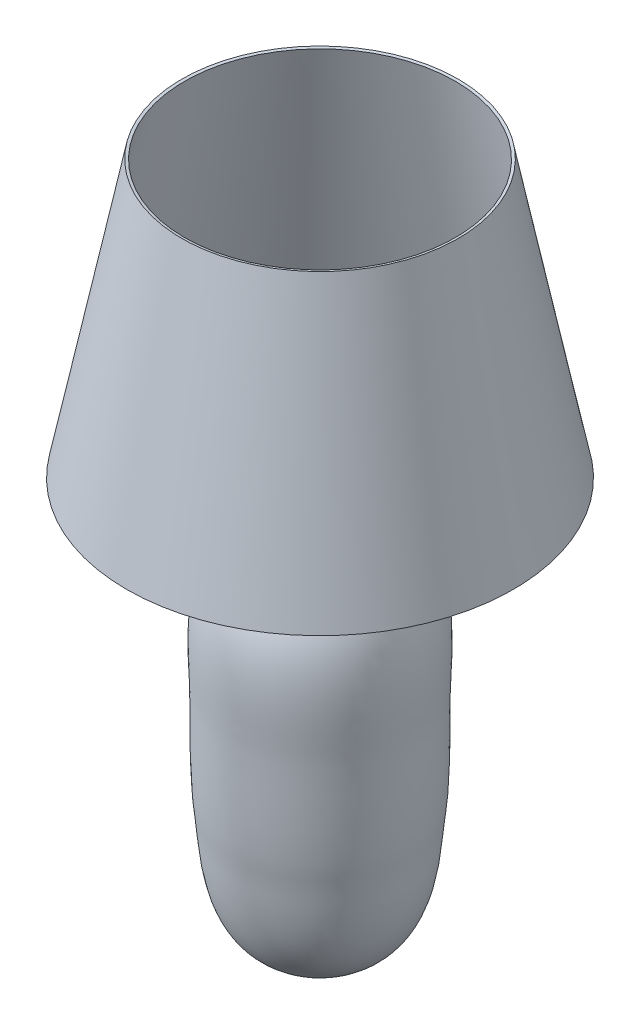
ISO-10303-21;
HEADER;
FILE_DESCRIPTION(('STEP AP214'),'2;1');
FILE_NAME('part.step','',(''),(''),'','','');
FILE_SCHEMA(('AUTOMOTIVE_DESIGN { 1 0 10303 214 1 1 1 1 }'));
ENDSEC;
DATA;
#1=APPLICATION_CONTEXT('core data for automotive mechanical design processes');
#2=APPLICATION_PROTOCOL_DEFINITION('international standard','automotive_design',2000,#1);
#3=PRODUCT_CONTEXT('',#1,'mechanical');
#4=PRODUCT('Part','Part','',(#3));
#5=PRODUCT_RELATED_PRODUCT_CATEGORY('part','',(#4));
#6=PRODUCT_DEFINITION_FORMATION('','',#4);
#7=PRODUCT_DEFINITION_CONTEXT('part definition',#1,'design');
#8=PRODUCT_DEFINITION('design','',#6,#7);
#9=PRODUCT_DEFINITION_SHAPE('','',#8);
#10=(LENGTH_UNIT() NAMED_UNIT(*) SI_UNIT(.MILLI.,.METRE.));
#11=(NAMED_UNIT(*) PLANE_ANGLE_UNIT() SI_UNIT($,.RADIAN.));
#12=(NAMED_UNIT(*) SI_UNIT($,.STERADIAN.) SOLID_ANGLE_UNIT());
#13=UNCERTAINTY_MEASURE_WITH_UNIT(LENGTH_MEASURE(1.E-05),#10,'distance_accuracy_value','');
#14=(GEOMETRIC_REPRESENTATION_CONTEXT(3) GLOBAL_UNCERTAINTY_ASSIGNED_CONTEXT((#13)) GLOBAL_UNIT_ASSIGNED_CONTEXT((#10,
#11,#12)) REPRESENTATION_CONTEXT('',''));
#15=CARTESIAN_POINT('',(0.,0.,0.));
#16=DIRECTION('',(0.,0.,1.));
#17=DIRECTION('',(1.,0.,0.));
#18=AXIS2_PLACEMENT_3D('',#15,#16,#17);
#19=CARTESIAN_POINT('',(875.943412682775,483.621135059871,0.));
#20=DIRECTION('',(0.,-1.,0.));
#21=DIRECTION('',(0.,0.,-1.));
#22=AXIS2_PLACEMENT_3D('',#19,#20,#21);
#23=CONICAL_SURFACE('',#22,206.340588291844,0.197395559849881);
#24=CARTESIAN_POINT('',(875.943412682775,780.032786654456,0.));
#25=DIRECTION('',(0.,-1.,0.));
#26=DIRECTION('',(0.,0.,-1.));
#27=AXIS2_PLACEMENT_3D('',#24,#25,#26);
#28=CIRCLE('',#27,147.058257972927);
#29=CARTESIAN_POINT('',(875.943412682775,780.032786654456,-147.058257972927));
#30=VERTEX_POINT('',#29);
#31=EDGE_CURVE('E10',#30,#30,#28,.T.);
#32=ORIENTED_EDGE('',*,*,#31,.F.);
#33=EDGE_LOOP('',(#32));
#34=FACE_BOUND('',#33,.T.);
#35=CARTESIAN_POINT('',(875.943412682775,483.621135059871,0.));
#36=DIRECTION('',(0.,-1.,0.));
#37=DIRECTION('',(0.,0.,-1.));
#38=AXIS2_PLACEMENT_3D('',#35,#36,#37);
#39=CIRCLE('',#38,206.340588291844);
#40=CARTESIAN_POINT('',(875.943412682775,483.621135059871,-206.340588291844));
#41=VERTEX_POINT('',#40);
#42=EDGE_CURVE('E71',#41,#41,#39,.T.);
#43=ORIENTED_EDGE('',*,*,#42,.T.);
#44=EDGE_LOOP('',(#43));
#45=FACE_BOUND('',#44,.T.);
#46=ADVANCED_FACE('F31',(#34,#45),#23,.F.);
#47=CARTESIAN_POINT('',(875.943412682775,780.621135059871,0.));
#48=DIRECTION('',(0.,1.,0.));
#49=DIRECTION('',(0.,0.,1.));
#50=AXIS2_PLACEMENT_3D('',#47,#48,#49);
#51=CONICAL_SURFACE('',#50,150.,1.37340076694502);
#52=ORIENTED_EDGE('',*,*,#31,.T.);
#53=EDGE_LOOP('',(#52));
#54=FACE_BOUND('',#53,.T.);
#55=CARTESIAN_POINT('',(875.943412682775,780.621135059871,0.));
#56=DIRECTION('',(0.,-1.,0.));
#57=DIRECTION('',(0.,0.,-1.));
#58=AXIS2_PLACEMENT_3D('',#55,#56,#57);
#59=CIRCLE('',#58,150.);
#60=CARTESIAN_POINT('',(875.943412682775,780.621135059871,-150.));
#61=VERTEX_POINT('',#60);
#62=EDGE_CURVE('E37',#61,#61,#59,.T.);
#63=ORIENTED_EDGE('',*,*,#62,.F.);
#64=EDGE_LOOP('',(#63));
#65=FACE_BOUND('',#64,.T.);
#66=ADVANCED_FACE('F118',(#54,#65),#51,.F.);
#67=CARTESIAN_POINT('',(875.943412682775,480.621135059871,0.));
#68=DIRECTION('',(0.,-1.,0.));
#69=DIRECTION('',(0.,0.,-1.));
#70=AXIS2_PLACEMENT_3D('',#67,#68,#69);
#71=CONICAL_SURFACE('',#70,210.,0.197395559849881);
#72=ORIENTED_EDGE('',*,*,#62,.T.);
#73=EDGE_LOOP('',(#72));
#74=FACE_BOUND('',#73,.T.);
#75=CARTESIAN_POINT('',(875.943412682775,480.621135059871,0.));
#76=DIRECTION('',(0.,-1.,0.));
#77=DIRECTION('',(0.,0.,-1.));
#78=AXIS2_PLACEMENT_3D('',#75,#76,#77);
#79=CIRCLE('',#78,210.);
#80=CARTESIAN_POINT('',(875.943412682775,480.621135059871,-210.));
#81=VERTEX_POINT('',#80);
#82=EDGE_CURVE('E41',#81,#81,#79,.T.);
#83=ORIENTED_EDGE('',*,*,#82,.F.);
#84=EDGE_LOOP('',(#83));
#85=FACE_BOUND('',#84,.T.);
#86=ADVANCED_FACE('F115',(#74,#85),#71,.T.);
#87=CARTESIAN_POINT('',(865.943412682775,480.621135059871,0.));
#88=DIRECTION('',(0.,-1.,0.));
#89=DIRECTION('',(0.,0.,-1.));
#90=AXIS2_PLACEMENT_3D('',#87,#88,#89);
#91=PLANE('',#90);
#92=ORIENTED_EDGE('',*,*,#82,.T.);
#93=EDGE_LOOP('',(#92));
#94=FACE_BOUND('',#93,.T.);
#95=CARTESIAN_POINT('',(875.943412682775,480.621135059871,0.));
#96=DIRECTION('',(0.,-1.,0.));
#97=DIRECTION('',(0.,0.,-1.));
#98=AXIS2_PLACEMENT_3D('',#95,#96,#97);
#99=CIRCLE('',#98,10.);
#100=CARTESIAN_POINT('',(875.943412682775,480.621135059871,-10.));
#101=VERTEX_POINT('',#100);
#102=EDGE_CURVE('E45',#101,#101,#99,.T.);
#103=ORIENTED_EDGE('',*,*,#102,.F.);
#104=EDGE_LOOP('',(#103));
#105=FACE_BOUND('',#104,.T.);
#106=ADVANCED_FACE('F111',(#94,#105),#91,.T.);
#107=CARTESIAN_POINT('',(875.943412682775,40.6211350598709,0.));
#108=DIRECTION('',(0.,-1.,0.));
#109=DIRECTION('',(0.,0.,-1.));
#110=AXIS2_PLACEMENT_3D('',#107,#108,#109);
#111=CYLINDRICAL_SURFACE('',#110,10.);
#112=ORIENTED_EDGE('',*,*,#102,.T.);
#113=EDGE_LOOP('',(#112));
#114=FACE_BOUND('',#113,.T.);
#115=CARTESIAN_POINT('',(875.943412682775,440.621135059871,0.));
#116=DIRECTION('',(0.,-1.,0.));
#117=DIRECTION('',(0.,0.,-1.));
#118=AXIS2_PLACEMENT_3D('',#115,#116,#117);
#119=CIRCLE('',#118,10.);
#120=CARTESIAN_POINT('',(875.943412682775,440.621135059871,-10.));
#121=VERTEX_POINT('',#120);
#122=EDGE_CURVE('E50',#121,#121,#119,.T.);
#123=ORIENTED_EDGE('',*,*,#122,.F.);
#124=EDGE_LOOP('',(#123));
#125=FACE_BOUND('',#124,.T.);
#126=ADVANCED_FACE('F107',(#114,#125),#111,.T.);
#127=CARTESIAN_POINT('',(828.443412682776,440.621135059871,0.));
#128=DIRECTION('',(0.,1.,0.));
#129=DIRECTION('',(0.,0.,1.));
#130=AXIS2_PLACEMENT_3D('',#127,#128,#129);
#131=PLANE('',#130);
#132=ORIENTED_EDGE('',*,*,#122,.T.);
#133=EDGE_LOOP('',(#132));
#134=FACE_BOUND('',#133,.T.);
#135=CARTESIAN_POINT('',(875.943412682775,440.621135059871,0.));
#136=DIRECTION('',(0.,-1.,0.));
#137=DIRECTION('',(0.,0.,-1.));
#138=AXIS2_PLACEMENT_3D('',#135,#136,#137);
#139=CIRCLE('',#138,47.5000000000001);
#140=CARTESIAN_POINT('',(875.943412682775,440.621135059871,-47.5000000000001));
#141=VERTEX_POINT('',#140);
#142=EDGE_CURVE('E53',#141,#141,#139,.T.);
#143=ORIENTED_EDGE('',*,*,#142,.F.);
#144=EDGE_LOOP('',(#143));
#145=FACE_BOUND('',#144,.T.);
#146=ADVANCED_FACE('F103',(#134,#145),#131,.T.);
#147=CARTESIAN_POINT('',(835.943412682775,40.6211350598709,0.));
#148=CARTESIAN_POINT('',(784.293239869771,62.3198451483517,0.));
#149=CARTESIAN_POINT('',(783.375095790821,140.255779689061,0.));
#150=CARTESIAN_POINT('',(776.187963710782,192.83547645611,0.));
#151=CARTESIAN_POINT('',(775.846769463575,249.312043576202,0.));
#152=CARTESIAN_POINT('',(776.149689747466,307.95190692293,0.));
#153=CARTESIAN_POINT('',(768.786562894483,366.548122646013,0.));
#154=CARTESIAN_POINT('',(800.160031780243,422.265295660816,0.));
#155=CARTESIAN_POINT('',(826.835757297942,435.904925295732,0.));
#156=CARTESIAN_POINT('',(828.90845791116,434.982570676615,0.));
#157=CARTESIAN_POINT('',(828.443412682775,440.621135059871,0.));
#158=B_SPLINE_CURVE_WITH_KNOTS('',3,(#147,#148,#149,#150,#151,#152,#153,#154,#155,#156,#157),
.UNSPECIFIED.,.F.,.F.,(4,1,1,1,1,1,1,1,4),(0.,0.244664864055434,0.281494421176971,
0.444805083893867,0.503002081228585,0.805267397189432,0.855039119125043,0.962936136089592,1.),.UNSPECIFIED.);
#159=CARTESIAN_POINT('',(875.943412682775,40.6211350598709,0.));
#160=DIRECTION('',(0.,-1.,0.));
#161=AXIS1_PLACEMENT('',#159,#160);
#162=SURFACE_OF_REVOLUTION('',#158,#161);
#163=ORIENTED_EDGE('',*,*,#142,.T.);
#164=EDGE_LOOP('',(#163));
#165=FACE_BOUND('',#164,.T.);
#166=CARTESIAN_POINT('',(875.943412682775,40.6211350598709,0.));
#167=DIRECTION('',(0.,-1.,0.));
#168=DIRECTION('',(0.,0.,-1.));
#169=AXIS2_PLACEMENT_3D('',#166,#167,#168);
#170=CIRCLE('',#169,40.);
#171=CARTESIAN_POINT('',(875.943412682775,40.6211350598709,-40.));
#172=VERTEX_POINT('',#171);
#173=EDGE_CURVE('E56',#172,#172,#170,.T.);
#174=ORIENTED_EDGE('',*,*,#173,.F.);
#175=EDGE_LOOP('',(#174));
#176=FACE_BOUND('',#175,.T.);
#177=ADVANCED_FACE('F99',(#165,#176),#162,.F.);
#178=CARTESIAN_POINT('',(875.943412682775,40.6211350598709,0.));
#179=DIRECTION('',(0.,-1.,0.));
#180=DIRECTION('',(0.,0.,-1.));
#181=AXIS2_PLACEMENT_3D('',#178,#179,#180);
#182=PLANE('',#181);
#183=ORIENTED_EDGE('',*,*,#173,.T.);
#184=EDGE_LOOP('',(#183));
#185=FACE_BOUND('',#184,.T.);
#186=ADVANCED_FACE('F95',(#185),#182,.T.);
#187=CARTESIAN_POINT('',(875.943412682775,43.6211350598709,0.));
#188=DIRECTION('',(0.,-1.,0.));
#189=DIRECTION('',(0.,0.,-1.));
#190=AXIS2_PLACEMENT_3D('',#187,#188,#189);
#191=PLANE('',#190);
#192=CARTESIAN_POINT('',(875.943412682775,43.6211350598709,0.));
#193=DIRECTION('',(0.,-1.,0.));
#194=DIRECTION('',(0.,0.,-1.));
#195=AXIS2_PLACEMENT_3D('',#192,#193,#194);
#196=CIRCLE('',#195,39.3890557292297);
#197=CARTESIAN_POINT('',(875.943412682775,43.6211350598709,-39.3890557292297));
#198=VERTEX_POINT('',#197);
#199=EDGE_CURVE('E59',#198,#198,#196,.T.);
#200=ORIENTED_EDGE('',*,*,#199,.F.);
#201=EDGE_LOOP('',(#200));
#202=FACE_BOUND('',#201,.T.);
#203=ADVANCED_FACE('F90',(#202),#191,.F.);
#204=CARTESIAN_POINT('',(836.554356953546,43.6211350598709,0.));
#205=CARTESIAN_POINT('',(830.324860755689,46.2989063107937,0.));
#206=CARTESIAN_POINT('',(824.897982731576,49.6669188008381,0.));
#207=CARTESIAN_POINT('',(815.374538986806,57.5011182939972,0.));
#208=CARTESIAN_POINT('',(811.277496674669,61.9696445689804,0.));
#209=CARTESIAN_POINT('',(804.191472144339,71.7410857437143,0.));
#210=CARTESIAN_POINT('',(801.20399260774,77.0443978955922,0.));
#211=CARTESIAN_POINT('',(796.14899129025,88.1867000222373,0.));
#212=CARTESIAN_POINT('',(794.082058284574,94.0250152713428,0.));
#213=CARTESIAN_POINT('',(788.972126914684,111.858494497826,0.));
#214=CARTESIAN_POINT('',(787.023360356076,124.169005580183,0.));
#215=CARTESIAN_POINT('',(785.045167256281,141.311333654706,0.));
#216=CARTESIAN_POINT('',(784.542433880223,146.805024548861,0.));
#217=CARTESIAN_POINT('',(783.86203191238,154.48002463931,0.));
#218=CARTESIAN_POINT('',(783.647485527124,156.944198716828,0.));
#219=CARTESIAN_POINT('',(783.215301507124,161.647441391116,0.));
#220=CARTESIAN_POINT('',(782.995779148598,163.886421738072,0.));
#221=CARTESIAN_POINT('',(782.534153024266,168.10283301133,0.));
#222=CARTESIAN_POINT('',(782.296371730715,170.093309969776,0.));
#223=CARTESIAN_POINT('',(781.832235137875,174.04750199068,0.));
#224=CARTESIAN_POINT('',(781.605858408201,176.011248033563,0.));
#225=CARTESIAN_POINT('',(781.291538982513,179.103720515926,0.));
#226=CARTESIAN_POINT('',(781.191107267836,180.162122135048,0.));
#227=CARTESIAN_POINT('',(780.998477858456,182.340386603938,0.));
#228=CARTESIAN_POINT('',(780.906304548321,183.458466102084,0.));
#229=CARTESIAN_POINT('',(780.64179083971,186.890570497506,0.));
#230=CARTESIAN_POINT('',(780.481464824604,189.282429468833,0.));
#231=CARTESIAN_POINT('',(779.753531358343,201.643772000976,0.));
#232=CARTESIAN_POINT('',(779.407597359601,212.816241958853,0.));
#233=CARTESIAN_POINT('',(779.004172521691,234.825801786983,0.));
#234=CARTESIAN_POINT('',(778.94629424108,245.664602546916,0.));
#235=CARTESIAN_POINT('',(778.936268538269,256.060015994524,0.));
#236=CARTESIAN_POINT('',(778.935918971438,257.190099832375,0.));
#237=CARTESIAN_POINT('',(778.936377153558,259.394774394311,0.));
#238=CARTESIAN_POINT('',(778.937227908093,260.46826567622,0.));
#239=CARTESIAN_POINT('',(778.940464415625,263.610792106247,0.));
#240=CARTESIAN_POINT('',(778.943442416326,265.603909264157,0.));
#241=CARTESIAN_POINT('',(778.943352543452,271.387372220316,0.));
#242=CARTESIAN_POINT('',(778.931282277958,274.982440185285,0.));
#243=CARTESIAN_POINT('',(778.848725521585,280.41526236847,0.));
#244=CARTESIAN_POINT('',(778.809396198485,282.238498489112,0.));
#245=CARTESIAN_POINT('',(778.708638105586,285.925312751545,0.));
#246=CARTESIAN_POINT('',(778.647999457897,287.786046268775,0.));
#247=CARTESIAN_POINT('',(778.44635296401,293.415270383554,0.));
#248=CARTESIAN_POINT('',(778.285634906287,297.230814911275,0.));
#249=CARTESIAN_POINT('',(777.812087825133,308.824767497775,0.));
#250=CARTESIAN_POINT('',(777.508106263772,316.750781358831,0.));
#251=CARTESIAN_POINT('',(777.383161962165,332.768723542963,0.));
#252=CARTESIAN_POINT('',(777.562262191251,340.860338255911,0.));
#253=CARTESIAN_POINT('',(778.85413678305,356.975766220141,0.));
#254=CARTESIAN_POINT('',(779.966846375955,364.999004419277,0.));
#255=CARTESIAN_POINT('',(783.566349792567,380.750856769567,0.));
#256=CARTESIAN_POINT('',(786.05326221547,388.481199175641,0.));
#257=CARTESIAN_POINT('',(791.142080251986,399.698320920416,0.));
#258=CARTESIAN_POINT('',(793.054174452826,403.342841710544,0.));
#259=CARTESIAN_POINT('',(796.391364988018,408.443201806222,0.));
#260=CARTESIAN_POINT('',(797.581780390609,410.082420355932,0.));
#261=CARTESIAN_POINT('',(799.502564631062,412.424584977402,0.));
#262=CARTESIAN_POINT('',(800.166217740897,413.185638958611,0.));
#263=CARTESIAN_POINT('',(801.544621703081,414.677799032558,0.));
#264=CARTESIAN_POINT('',(802.257485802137,415.40738543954,0.));
#265=CARTESIAN_POINT('',(805.912805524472,418.965271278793,0.));
#266=CARTESIAN_POINT('',(809.129203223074,421.521829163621,0.));
#267=CARTESIAN_POINT('',(815.424943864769,425.890688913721,0.));
#268=CARTESIAN_POINT('',(818.505416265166,427.70427423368,0.));
#269=CARTESIAN_POINT('',(822.461530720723,429.759875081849,0.));
#270=CARTESIAN_POINT('',(823.669664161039,430.334406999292,0.));
#271=CARTESIAN_POINT('',(825.233265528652,431.014475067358,0.));
#272=CARTESIAN_POINT('',(825.71294836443,431.210846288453,0.));
#273=CARTESIAN_POINT('',(826.570143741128,431.539476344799,0.));
#274=CARTESIAN_POINT('',(826.948207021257,431.671735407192,0.));
#275=CARTESIAN_POINT('',(827.337114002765,431.794181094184,0.));
#276=CARTESIAN_POINT('',(827.410648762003,431.816524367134,0.));
#277=CARTESIAN_POINT('',(827.548356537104,431.856851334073,0.));
#278=CARTESIAN_POINT('',(827.615510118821,431.87564492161,0.));
#279=CARTESIAN_POINT('',(827.843048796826,431.938250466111,0.));
#280=CARTESIAN_POINT('',(828.019959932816,431.984350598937,0.));
#281=CARTESIAN_POINT('',(828.463306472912,432.121131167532,0.));
#282=CARTESIAN_POINT('',(828.732852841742,432.211419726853,0.));
#283=CARTESIAN_POINT('',(829.209640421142,432.442024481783,0.));
#284=CARTESIAN_POINT('',(829.379973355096,432.535354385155,0.));
#285=CARTESIAN_POINT('',(829.729383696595,432.7642861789,0.));
#286=CARTESIAN_POINT('',(829.90819357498,432.900195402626,0.));
#287=CARTESIAN_POINT('',(830.250691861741,433.212394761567,0.));
#288=CARTESIAN_POINT('',(830.413827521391,433.388499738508,0.));
#289=CARTESIAN_POINT('',(830.704701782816,433.763694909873,0.));
#290=CARTESIAN_POINT('',(830.832325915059,433.962247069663,0.));
#291=CARTESIAN_POINT('',(831.048081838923,434.361930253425,0.));
#292=CARTESIAN_POINT('',(831.136534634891,434.562865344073,0.));
#293=CARTESIAN_POINT('',(831.281921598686,434.957131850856,0.));
#294=CARTESIAN_POINT('',(831.339099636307,435.150601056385,0.));
#295=CARTESIAN_POINT('',(831.478156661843,435.719972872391,0.));
#296=CARTESIAN_POINT('',(831.529173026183,436.084788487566,0.));
#297=CARTESIAN_POINT('',(831.593036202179,436.829486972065,0.));
#298=CARTESIAN_POINT('',(831.605005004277,437.210389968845,0.));
#299=CARTESIAN_POINT('',(831.604323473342,437.621135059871,0.));
#300=B_SPLINE_CURVE_WITH_KNOTS('',3,(#204,#205,#206,#207,#208,#209,#210,#211,#212,#213,#214,
#215,#216,#217,#218,#219,#220,#221,#222,#223,#224,#225,#226,#227,#228,#229,#230,#231,#232,#233,
#234,#235,#236,#237,#238,#239,#240,#241,#242,#243,#244,#245,#246,#247,#248,#249,#250,#251,#252,
#253,#254,#255,#256,#257,#258,#259,#260,#261,#262,#263,#264,#265,#266,#267,#268,#269,#270,#271,
#272,#273,#274,#275,#276,#277,#278,#279,#280,#281,#282,#283,#284,#285,#286,#287,#288,#289,#290,
#291,#292,#293,#294,#295,#296,#297,#298,#299),.UNSPECIFIED.,.F.,.F.,(4,2,2,2,2,2,2,2,2,2,2,2,2,
2,2,2,2,2,2,2,2,2,2,2,2,2,2,2,2,2,2,2,2,2,2,2,2,2,2,2,2,2,2,2,2,2,2,4),(0.,0.0312499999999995,
0.0624999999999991,0.0937499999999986,0.124999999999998,0.187499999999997,0.218749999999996,
0.234374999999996,0.249999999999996,0.265624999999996,0.281249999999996,0.289062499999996,
0.296874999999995,0.312499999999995,0.374999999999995,0.437499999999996,0.445312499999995,
0.453124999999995,0.468749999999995,0.499999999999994,0.515624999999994,0.531249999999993,
0.562499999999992,0.62499999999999,0.687499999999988,0.749999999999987,0.812499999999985,
0.843749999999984,0.859374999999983,0.867187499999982,0.874999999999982,0.906249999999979,
0.937499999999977,0.953124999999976,0.960937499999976,0.968749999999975,0.970703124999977,
0.972656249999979,0.976562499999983,0.980468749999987,0.982421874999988,0.98437499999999,
0.986328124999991,0.988281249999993,0.990234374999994,0.992187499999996,0.996093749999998,1.),.UNSPECIFIED.);
#301=CARTESIAN_POINT('',(875.943412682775,40.6211350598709,0.));
#302=DIRECTION('',(0.,-1.,0.));
#303=AXIS1_PLACEMENT('',#301,#302);
#304=SURFACE_OF_REVOLUTION('',#300,#303);
#305=CARTESIAN_POINT('',(875.943412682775,437.621135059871,0.));
#306=DIRECTION('',(0.,-1.,0.));
#307=DIRECTION('',(0.,0.,-1.));
#308=AXIS2_PLACEMENT_3D('',#305,#306,#307);
#309=CIRCLE('',#308,44.3390892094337);
#310=CARTESIAN_POINT('',(875.943412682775,437.621135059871,-44.3390892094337));
#311=VERTEX_POINT('',#310);
#312=EDGE_CURVE('E62',#311,#311,#309,.T.);
#313=ORIENTED_EDGE('',*,*,#312,.F.);
#314=EDGE_LOOP('',(#313));
#315=FACE_BOUND('',#314,.T.);
#316=ORIENTED_EDGE('',*,*,#199,.T.);
#317=EDGE_LOOP('',(#316));
#318=FACE_BOUND('',#317,.T.);
#319=ADVANCED_FACE('F85',(#315,#318),#304,.T.);
#320=CARTESIAN_POINT('',(828.443412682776,437.621135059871,0.));
#321=DIRECTION('',(0.,1.,0.));
#322=DIRECTION('',(0.,0.,1.));
#323=AXIS2_PLACEMENT_3D('',#320,#321,#322);
#324=PLANE('',#323);
#325=CARTESIAN_POINT('',(875.943412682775,437.621135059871,0.));
#326=DIRECTION('',(0.,-1.,0.));
#327=DIRECTION('',(0.,0.,-1.));
#328=AXIS2_PLACEMENT_3D('',#325,#326,#327);
#329=CIRCLE('',#328,7.00000000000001);
#330=CARTESIAN_POINT('',(875.943412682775,437.621135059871,-7.00000000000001));
#331=VERTEX_POINT('',#330);
#332=EDGE_CURVE('E65',#331,#331,#329,.T.);
#333=ORIENTED_EDGE('',*,*,#332,.F.);
#334=EDGE_LOOP('',(#333));
#335=FACE_BOUND('',#334,.T.);
#336=ORIENTED_EDGE('',*,*,#312,.T.);
#337=EDGE_LOOP('',(#336));
#338=FACE_BOUND('',#337,.T.);
#339=ADVANCED_FACE('F89',(#335,#338),#324,.F.);
#340=CARTESIAN_POINT('',(875.943412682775,40.6211350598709,0.));
#341=DIRECTION('',(0.,-1.,0.));
#342=DIRECTION('',(0.,0.,-1.));
#343=AXIS2_PLACEMENT_3D('',#340,#341,#342);
#344=CYLINDRICAL_SURFACE('',#343,7.00000000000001);
#345=CARTESIAN_POINT('',(875.943412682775,483.621135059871,0.));
#346=DIRECTION('',(0.,-1.,0.));
#347=DIRECTION('',(0.,0.,-1.));
#348=AXIS2_PLACEMENT_3D('',#345,#346,#347);
#349=CIRCLE('',#348,7.00000000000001);
#350=CARTESIAN_POINT('',(875.943412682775,483.621135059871,-7.00000000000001));
#351=VERTEX_POINT('',#350);
#352=EDGE_CURVE('E68',#351,#351,#349,.T.);
#353=ORIENTED_EDGE('',*,*,#352,.F.);
#354=EDGE_LOOP('',(#353));
#355=FACE_BOUND('',#354,.T.);
#356=ORIENTED_EDGE('',*,*,#332,.T.);
#357=EDGE_LOOP('',(#356));
#358=FACE_BOUND('',#357,.T.);
#359=ADVANCED_FACE('F133',(#355,#358),#344,.F.);
#360=CARTESIAN_POINT('',(865.943412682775,483.621135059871,0.));
#361=DIRECTION('',(0.,-1.,0.));
#362=DIRECTION('',(0.,0.,-1.));
#363=AXIS2_PLACEMENT_3D('',#360,#361,#362);
#364=PLANE('',#363);
#365=ORIENTED_EDGE('',*,*,#42,.F.);
#366=EDGE_LOOP('',(#365));
#367=FACE_BOUND('',#366,.T.);
#368=ORIENTED_EDGE('',*,*,#352,.T.);
#369=EDGE_LOOP('',(#368));
#370=FACE_BOUND('',#369,.T.);
#371=ADVANCED_FACE('F130',(#367,#370),#364,.F.);
#372=CLOSED_SHELL('',(#46,#66,#86,#106,#126,#146,#177,#186,#203,#319,#339,#359,#371));
#373=MANIFOLD_SOLID_BREP('B2',#372);
#374=ADVANCED_BREP_SHAPE_REPRESENTATION('',(#18,#373),#14);
#375=SHAPE_DEFINITION_REPRESENTATION(#9,#374);
ENDSEC;
END-ISO-10303-21;
